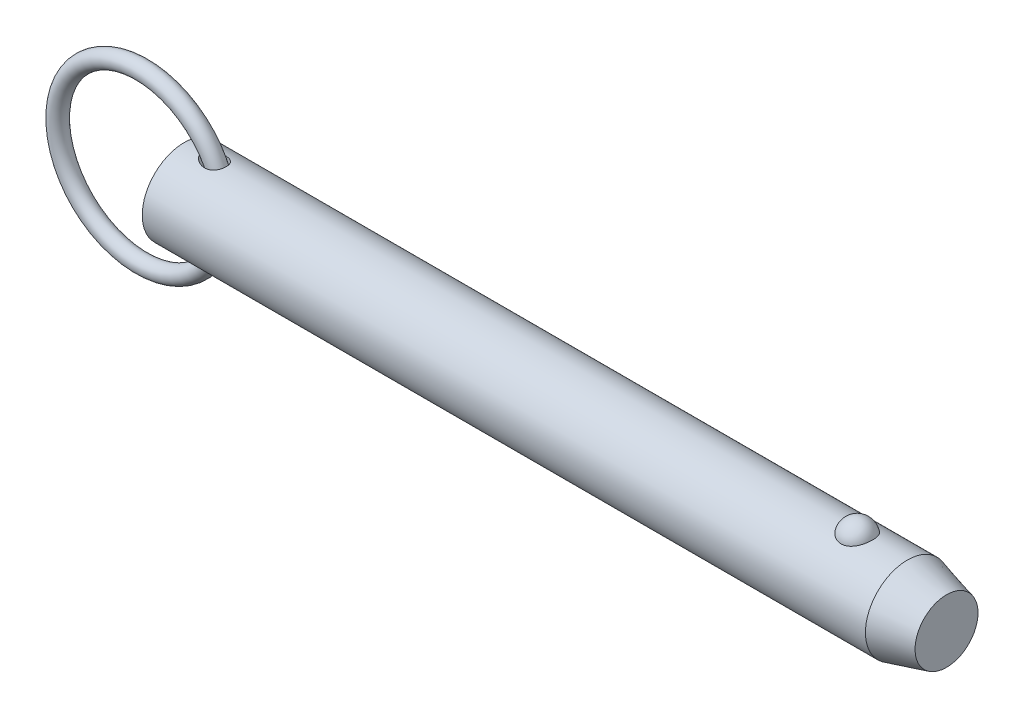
ISO-10303-21;
HEADER;
FILE_DESCRIPTION(('STEP AP214'),'2;1');
FILE_NAME('part.step','',(''),(''),'','','');
FILE_SCHEMA(('AUTOMOTIVE_DESIGN { 1 0 10303 214 1 1 1 1 }'));
ENDSEC;
DATA;
#1=APPLICATION_CONTEXT('core data for automotive mechanical design processes');
#2=APPLICATION_PROTOCOL_DEFINITION('international standard','automotive_design',2000,#1);
#3=PRODUCT_CONTEXT('',#1,'mechanical');
#4=PRODUCT('Part','Part','',(#3));
#5=PRODUCT_RELATED_PRODUCT_CATEGORY('part','',(#4));
#6=PRODUCT_DEFINITION_FORMATION('','',#4);
#7=PRODUCT_DEFINITION_CONTEXT('part definition',#1,'design');
#8=PRODUCT_DEFINITION('design','',#6,#7);
#9=PRODUCT_DEFINITION_SHAPE('','',#8);
#10=(LENGTH_UNIT() NAMED_UNIT(*) SI_UNIT(.MILLI.,.METRE.));
#11=(NAMED_UNIT(*) PLANE_ANGLE_UNIT() SI_UNIT($,.RADIAN.));
#12=(NAMED_UNIT(*) SI_UNIT($,.STERADIAN.) SOLID_ANGLE_UNIT());
#13=UNCERTAINTY_MEASURE_WITH_UNIT(LENGTH_MEASURE(1.E-05),#10,'distance_accuracy_value','');
#14=(GEOMETRIC_REPRESENTATION_CONTEXT(3) GLOBAL_UNCERTAINTY_ASSIGNED_CONTEXT((#13)) GLOBAL_UNIT_ASSIGNED_CONTEXT((#10,
#11,#12)) REPRESENTATION_CONTEXT('',''));
#15=CARTESIAN_POINT('',(0.,0.,0.));
#16=DIRECTION('',(0.,0.,1.));
#17=DIRECTION('',(1.,0.,0.));
#18=AXIS2_PLACEMENT_3D('',#15,#16,#17);
#19=CARTESIAN_POINT('',(-9.66825126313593,0.,0.));
#20=DIRECTION('',(0.,0.,1.));
#21=DIRECTION('',(1.,0.,0.));
#22=AXIS2_PLACEMENT_3D('',#19,#20,#21);
#23=TOROIDAL_SURFACE('',#22,19.05,1.905);
#24=CARTESIAN_POINT('',(11.2867487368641,0.,0.));
#25=VERTEX_POINT('',#24);
#26=VERTEX_LOOP('',#25);
#27=FACE_BOUND('',#26,.T.);
#28=ADVANCED_FACE('P0_F12',(#27),#23,.T.);
#29=CLOSED_SHELL('',(#28));
#30=MANIFOLD_SOLID_BREP('P0_B1',#29);
#31=CARTESIAN_POINT('',(0.,0.,0.));
#32=DIRECTION('',(1.,0.,0.));
#33=DIRECTION('',(0.,0.,-1.));
#34=AXIS2_PLACEMENT_3D('',#31,#32,#33);
#35=CYLINDRICAL_SURFACE('',#34,9.525);
#36=CARTESIAN_POINT('',(4.5669340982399,9.4314194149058,-1.33189820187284));
#37=CARTESIAN_POINT('',(4.70260475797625,9.41020313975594,-1.48215931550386));
#38=CARTESIAN_POINT('',(4.85555680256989,9.38755003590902,-1.61683982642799));
#39=CARTESIAN_POINT('',(5.10171959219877,9.35450554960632,-1.79512943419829));
#40=CARTESIAN_POINT('',(5.18674514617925,9.34362629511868,-1.85068909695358));
#41=CARTESIAN_POINT('',(5.3615438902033,9.32258514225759,-1.95392002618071));
#42=CARTESIAN_POINT('',(5.45131542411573,9.31242299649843,-2.00159402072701));
#43=CARTESIAN_POINT('',(5.70070211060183,9.28632120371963,-2.12033289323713));
#44=CARTESIAN_POINT('',(5.86420408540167,9.2714693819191,-2.18362944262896));
#45=CARTESIAN_POINT('',(6.19893345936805,9.24694163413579,-2.28525783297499));
#46=CARTESIAN_POINT('',(6.37015384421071,9.23726110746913,-2.32361187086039));
#47=CARTESIAN_POINT('',(6.73531776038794,9.22400982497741,-2.37575048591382));
#48=CARTESIAN_POINT('',(6.92975826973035,9.22118808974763,-2.38652934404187));
#49=CARTESIAN_POINT('',(7.21995443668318,9.22416297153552,-2.37494980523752));
#50=CARTESIAN_POINT('',(7.31643847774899,9.22635560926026,-2.366466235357));
#51=CARTESIAN_POINT('',(7.50796421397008,9.2331428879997,-2.33985028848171));
#52=CARTESIAN_POINT('',(7.6030065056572,9.23773650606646,-2.32172202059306));
#53=CARTESIAN_POINT('',(7.83273114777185,9.25183311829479,-2.26504721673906));
#54=CARTESIAN_POINT('',(7.96603028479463,9.26261470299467,-2.2209856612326));
#55=CARTESIAN_POINT('',(8.22310899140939,9.28816519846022,-2.11157306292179));
#56=CARTESIAN_POINT('',(8.34689477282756,9.30293147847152,-2.04623606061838));
#57=CARTESIAN_POINT('',(8.58136049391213,9.3349416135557,-1.89485344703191));
#58=CARTESIAN_POINT('',(8.69199721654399,9.35219324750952,-1.80874222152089));
#59=CARTESIAN_POINT('',(8.89592093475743,9.38707016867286,-1.6179918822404));
#60=CARTESIAN_POINT('',(8.98920771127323,9.40469546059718,-1.51335253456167));
#61=CARTESIAN_POINT('',(9.15057731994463,9.43713590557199,-1.29519427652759));
#62=CARTESIAN_POINT('',(9.21980158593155,9.45205440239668,-1.18253282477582));
#63=CARTESIAN_POINT('',(9.33826736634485,9.47856708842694,-0.946802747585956));
#64=CARTESIAN_POINT('',(9.38751161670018,9.49016173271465,-0.823735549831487));
#65=CARTESIAN_POINT('',(9.46423850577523,9.50859378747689,-0.572614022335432));
#66=CARTESIAN_POINT('',(9.49202393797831,9.5154972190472,-0.444656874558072));
#67=CARTESIAN_POINT('',(9.52636926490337,9.5240690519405,-0.18575268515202));
#68=CARTESIAN_POINT('',(9.53292923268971,9.52573747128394,-0.0548056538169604));
#69=CARTESIAN_POINT('',(9.52467276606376,9.52365852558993,0.206503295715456));
#70=CARTESIAN_POINT('',(9.50983454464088,9.51990564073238,0.33686448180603));
#71=CARTESIAN_POINT('',(9.45907362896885,9.50737852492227,0.593166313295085));
#72=CARTESIAN_POINT('',(9.42315106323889,9.49860432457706,0.719106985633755));
#73=CARTESIAN_POINT('',(9.33106648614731,9.4769892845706,0.962959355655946));
#74=CARTESIAN_POINT('',(9.27490839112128,9.46414923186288,1.08087260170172));
#75=CARTESIAN_POINT('',(9.14375803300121,9.43581000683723,1.30534632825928));
#76=CARTESIAN_POINT('',(9.06876720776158,9.42031103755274,1.41190767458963));
#77=CARTESIAN_POINT('',(8.90203187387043,9.38836719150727,1.61069439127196));
#78=CARTESIAN_POINT('',(8.81029913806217,9.37192298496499,1.70292975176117));
#79=CARTESIAN_POINT('',(8.61268775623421,9.33985045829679,1.87086859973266));
#80=CARTESIAN_POINT('',(8.50680947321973,9.3242221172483,1.94657251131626));
#81=CARTESIAN_POINT('',(8.28220546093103,9.29513431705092,2.08109032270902));
#82=CARTESIAN_POINT('',(8.16329919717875,9.28171415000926,2.13961034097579));
#83=CARTESIAN_POINT('',(7.91756052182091,9.25859072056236,2.23755716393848));
#84=CARTESIAN_POINT('',(7.79072606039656,9.24888842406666,2.27697900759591));
#85=CARTESIAN_POINT('',(7.52377913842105,9.23338749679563,2.33907806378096));
#86=CARTESIAN_POINT('',(7.38334767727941,9.22789571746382,2.36044900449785));
#87=CARTESIAN_POINT('',(7.10081394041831,9.22210229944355,2.3829751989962));
#88=CARTESIAN_POINT('',(6.95871103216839,9.22180269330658,2.38412253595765));
#89=CARTESIAN_POINT('',(6.65642691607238,9.22632724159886,2.36656230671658));
#90=CARTESIAN_POINT('',(6.49641694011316,9.23185415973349,2.3451317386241));
#91=CARTESIAN_POINT('',(6.18115433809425,9.24811737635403,2.28014143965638));
#92=CARTESIAN_POINT('',(6.02590710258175,9.25885936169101,2.23655754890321));
#93=CARTESIAN_POINT('',(5.69904720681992,9.28624254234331,2.12025087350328));
#94=CARTESIAN_POINT('',(5.52873601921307,9.30354853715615,2.04400672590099));
#95=CARTESIAN_POINT('',(5.20289495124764,9.34106989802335,1.86504730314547));
#96=CARTESIAN_POINT('',(5.04735968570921,9.36128419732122,1.76234172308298));
#97=CARTESIAN_POINT('',(4.7928712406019,9.39697639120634,1.55895334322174));
#98=CARTESIAN_POINT('',(4.68938704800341,9.41240250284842,1.46392900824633));
#99=CARTESIAN_POINT('',(4.4984714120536,9.44202586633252,1.25875918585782));
#100=CARTESIAN_POINT('',(4.41101129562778,9.45622528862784,1.1486413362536));
#101=CARTESIAN_POINT('',(4.27502257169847,9.47888210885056,0.940600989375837));
#102=CARTESIAN_POINT('',(4.22216329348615,9.48791121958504,0.84558680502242));
#103=CARTESIAN_POINT('',(4.1324147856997,9.50344321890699,0.648051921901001));
#104=CARTESIAN_POINT('',(4.0955118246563,9.50994827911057,0.545537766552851));
#105=CARTESIAN_POINT('',(4.04043124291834,9.51971586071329,0.334452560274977));
#106=CARTESIAN_POINT('',(4.02240728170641,9.52295176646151,0.22583927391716));
#107=CARTESIAN_POINT('',(4.00750873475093,9.52562364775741,0.00713006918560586));
#108=CARTESIAN_POINT('',(4.01062334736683,9.52506156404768,-0.102965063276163));
#109=CARTESIAN_POINT('',(4.03592967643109,9.52053221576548,-0.306944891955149));
#110=CARTESIAN_POINT('',(4.05571676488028,9.51699426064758,-0.401151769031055));
#111=CARTESIAN_POINT('',(4.10967975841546,9.5074546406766,-0.585176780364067));
#112=CARTESIAN_POINT('',(4.1438599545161,9.50145224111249,-0.674993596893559));
#113=CARTESIAN_POINT('',(4.23261356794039,9.48611703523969,-0.866116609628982));
#114=CARTESIAN_POINT('',(4.28990016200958,9.47635800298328,-0.966121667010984));
#115=CARTESIAN_POINT('',(4.41856577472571,9.45502867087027,-1.15640011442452));
#116=CARTESIAN_POINT('',(4.48996918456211,9.44345524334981,-1.24665623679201));
#117=CARTESIAN_POINT('',(4.5669340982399,9.4314194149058,-1.33189820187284));
#118=B_SPLINE_CURVE_WITH_KNOTS('',3,(#36,#37,#38,#39,#40,#41,#42,#43,#44,#45,#46,#47,#48,#49,
#50,#51,#52,#53,#54,#55,#56,#57,#58,#59,#60,#61,#62,#63,#64,#65,#66,#67,#68,#69,#70,#71,#72,#73,
#74,#75,#76,#77,#78,#79,#80,#81,#82,#83,#84,#85,#86,#87,#88,#89,#90,#91,#92,#93,#94,#95,#96,#97,
#98,#99,#100,#101,#102,#103,#104,#105,#106,#107,#108,#109,#110,#111,#112,#113,#114,#115,#116,
#117),.UNSPECIFIED.,.T.,.F.,(4,2,2,2,2,2,2,2,2,2,2,2,2,2,2,2,2,2,2,2,2,2,2,2,2,2,2,2,2,2,2,2,2,
2,2,2,2,2,2,2,4),(0.,0.609951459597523,0.916123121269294,1.22218863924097,1.74791337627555,
2.27316961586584,2.85362722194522,3.14383229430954,3.43391382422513,3.85437497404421,
4.27455920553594,4.69608835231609,5.11762282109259,5.5149005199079,5.91212379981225,
6.30363414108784,6.69514313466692,7.08705103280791,7.47895654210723,7.87078624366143,
8.26258603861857,8.65411137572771,9.04562666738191,9.44349251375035,9.84146165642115,
10.2662286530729,10.6911619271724,11.1739180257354,11.6572017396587,12.2170157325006,
12.776624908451,13.1992556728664,13.6211226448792,13.9471990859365,14.2729943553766,
14.6014211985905,14.9296802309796,15.2173810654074,15.505167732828,15.8505863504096,
16.1966070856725),.UNSPECIFIED.);
#119=CARTESIAN_POINT('',(4.5669340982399,9.4314194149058,-1.33189820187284));
#120=VERTEX_POINT('',#119);
#121=EDGE_CURVE('P1_E40',#120,#120,#118,.T.);
#122=ORIENTED_EDGE('',*,*,#121,.T.);
#123=EDGE_LOOP('',(#122));
#124=FACE_BOUND('',#123,.T.);
#125=CARTESIAN_POINT('',(164.143054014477,0.,0.));
#126=DIRECTION('',(1.,0.,0.));
#127=DIRECTION('',(0.,0.,-1.));
#128=AXIS2_PLACEMENT_3D('',#125,#126,#127);
#129=CIRCLE('',#128,9.525);
#130=CARTESIAN_POINT('',(164.143054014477,0.,-9.525));
#131=VERTEX_POINT('',#130);
#132=EDGE_CURVE('P1_E25',#131,#131,#129,.T.);
#133=ORIENTED_EDGE('',*,*,#132,.F.);
#134=EDGE_LOOP('',(#133));
#135=FACE_BOUND('',#134,.T.);
#136=CARTESIAN_POINT('',(0.,0.,0.));
#137=DIRECTION('',(1.,0.,0.));
#138=DIRECTION('',(0.,0.,-1.));
#139=AXIS2_PLACEMENT_3D('',#136,#137,#138);
#140=CIRCLE('',#139,9.525);
#141=CARTESIAN_POINT('',(0.,0.,-9.525));
#142=VERTEX_POINT('',#141);
#143=EDGE_CURVE('P1_E9',#142,#142,#140,.T.);
#144=ORIENTED_EDGE('',*,*,#143,.T.);
#145=EDGE_LOOP('',(#144));
#146=FACE_BOUND('',#145,.T.);
#147=CARTESIAN_POINT('',(152.745757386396,8.80405803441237,3.63513233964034));
#148=CARTESIAN_POINT('',(152.651676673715,8.80405953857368,3.63513053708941));
#149=CARTESIAN_POINT('',(152.557561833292,8.80561325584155,3.63137461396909));
#150=CARTESIAN_POINT('',(152.370012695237,8.81177748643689,3.61638665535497));
#151=CARTESIAN_POINT('',(152.276578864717,8.81638992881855,3.60514990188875));
#152=CARTESIAN_POINT('',(151.997945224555,8.83467114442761,3.56024627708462));
#153=CARTESIAN_POINT('',(151.814691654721,8.85278327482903,3.5153862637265));
#154=CARTESIAN_POINT('',(151.459509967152,8.89871214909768,3.39742145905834));
#155=CARTESIAN_POINT('',(151.287553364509,8.92650327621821,3.32439116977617));
#156=CARTESIAN_POINT('',(150.958707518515,8.9887481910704,3.15220244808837));
#157=CARTESIAN_POINT('',(150.801811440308,9.02319893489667,3.05305594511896));
#158=CARTESIAN_POINT('',(150.502214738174,9.09629186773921,2.82797815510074));
#159=CARTESIAN_POINT('',(150.360060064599,9.13502685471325,2.70135138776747));
#160=CARTESIAN_POINT('',(150.098299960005,9.21186572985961,2.42641932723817));
#161=CARTESIAN_POINT('',(149.978701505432,9.24996941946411,2.2781073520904));
#162=CARTESIAN_POINT('',(149.759645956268,9.32341082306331,1.95652290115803));
#163=CARTESIAN_POINT('',(149.661317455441,9.35855090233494,1.78243511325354));
#164=CARTESIAN_POINT('',(149.493819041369,9.42045142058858,1.41937246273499));
#165=CARTESIAN_POINT('',(149.424651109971,9.44721128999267,1.23039658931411));
#166=CARTESIAN_POINT('',(149.316199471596,9.48990641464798,0.840370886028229));
#167=CARTESIAN_POINT('',(149.277288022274,9.50570658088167,0.639202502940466));
#168=CARTESIAN_POINT('',(149.231555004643,9.52433146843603,0.232664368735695));
#169=CARTESIAN_POINT('',(149.224732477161,9.52715657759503,0.027294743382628));
#170=CARTESIAN_POINT('',(149.243255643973,9.51956918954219,-0.380478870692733));
#171=CARTESIAN_POINT('',(149.268405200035,9.50923740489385,-0.582893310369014));
#172=CARTESIAN_POINT('',(149.35002537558,9.47651897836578,-0.98029399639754));
#173=CARTESIAN_POINT('',(149.406496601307,9.45413210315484,-1.17528009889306));
#174=CARTESIAN_POINT('',(149.549719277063,9.39954044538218,-1.55263697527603));
#175=CARTESIAN_POINT('',(149.636512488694,9.36732213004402,-1.73498993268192));
#176=CARTESIAN_POINT('',(149.838610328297,9.29640700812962,-2.08177763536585));
#177=CARTESIAN_POINT('',(149.953917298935,9.25770966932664,-2.24621090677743));
#178=CARTESIAN_POINT('',(150.211264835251,9.17775604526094,-2.5533833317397));
#179=CARTESIAN_POINT('',(150.353434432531,9.136488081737,-2.696011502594));
#180=CARTESIAN_POINT('',(150.66089985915,9.05620497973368,-2.95451229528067));
#181=CARTESIAN_POINT('',(150.826193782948,9.01718965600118,-3.07038711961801));
#182=CARTESIAN_POINT('',(151.172052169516,8.94680019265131,-3.26976836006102));
#183=CARTESIAN_POINT('',(151.352227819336,8.91528408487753,-3.353897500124));
#184=CARTESIAN_POINT('',(151.725651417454,8.86272514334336,-3.49043503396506));
#185=CARTESIAN_POINT('',(151.918894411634,8.84167836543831,-3.54285537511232));
#186=CARTESIAN_POINT('',(152.302503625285,8.81348056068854,-3.61241306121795));
#187=CARTESIAN_POINT('',(152.492525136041,8.80568348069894,-3.6311933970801));
#188=CARTESIAN_POINT('',(152.873190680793,8.80289410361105,-3.63795342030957));
#189=CARTESIAN_POINT('',(153.063834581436,8.80789922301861,-3.62593932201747));
#190=CARTESIAN_POINT('',(153.434007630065,8.82974915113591,-3.57238430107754));
#191=CARTESIAN_POINT('',(153.613697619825,8.84621463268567,-3.53178890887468));
#192=CARTESIAN_POINT('',(153.963422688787,8.88875330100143,-3.42331083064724));
#193=CARTESIAN_POINT('',(154.133456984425,8.91482726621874,-3.35542593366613));
#194=CARTESIAN_POINT('',(154.463237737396,8.97448239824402,-3.19248225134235));
#195=CARTESIAN_POINT('',(154.622680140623,9.00821446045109,-3.0968647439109));
#196=CARTESIAN_POINT('',(154.923513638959,9.07935398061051,-2.88162736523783));
#197=CARTESIAN_POINT('',(155.064900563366,9.11676228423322,-2.76200196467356));
#198=CARTESIAN_POINT('',(155.33331931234,9.19347419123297,-2.49516285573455));
#199=CARTESIAN_POINT('',(155.459275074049,9.23277872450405,-2.34686614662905));
#200=CARTESIAN_POINT('',(155.685522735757,9.30737610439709,-2.03093683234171));
#201=CARTESIAN_POINT('',(155.78581004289,9.34266823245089,-1.86330077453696));
#202=CARTESIAN_POINT('',(155.961514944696,9.40674710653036,-1.50744893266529));
#203=CARTESIAN_POINT('',(156.036041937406,9.43529176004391,-1.31874876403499));
#204=CARTESIAN_POINT('',(156.15416505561,9.48144132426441,-0.930631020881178));
#205=CARTESIAN_POINT('',(156.197760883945,9.49904612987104,-0.731213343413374));
#206=CARTESIAN_POINT('',(156.253158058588,9.5215314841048,-0.327147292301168));
#207=CARTESIAN_POINT('',(156.264935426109,9.52640243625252,-0.122495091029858));
#208=CARTESIAN_POINT('',(156.256382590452,9.5228957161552,0.286018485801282));
#209=CARTESIAN_POINT('',(156.23605305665,9.5145183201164,0.489879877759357));
#210=CARTESIAN_POINT('',(156.163884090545,9.48544083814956,0.889994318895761));
#211=CARTESIAN_POINT('',(156.112199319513,9.46480124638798,1.08627971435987));
#212=CARTESIAN_POINT('',(155.978491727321,9.4133389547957,1.46682086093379));
#213=CARTESIAN_POINT('',(155.896466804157,9.38251554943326,1.65107577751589));
#214=CARTESIAN_POINT('',(155.70319292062,9.31365636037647,2.00346348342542));
#215=CARTESIAN_POINT('',(155.591783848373,9.27558138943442,2.17150083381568));
#216=CARTESIAN_POINT('',(155.342294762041,9.19638714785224,2.48563115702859));
#217=CARTESIAN_POINT('',(155.204216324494,9.15526805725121,2.63172542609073));
#218=CARTESIAN_POINT('',(154.904843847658,9.07465393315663,2.89750997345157));
#219=CARTESIAN_POINT('',(154.743610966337,9.03515496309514,3.01726776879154));
#220=CARTESIAN_POINT('',(154.401613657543,8.96227564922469,3.22732920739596));
#221=CARTESIAN_POINT('',(154.220841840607,8.92889763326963,3.31762165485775));
#222=CARTESIAN_POINT('',(153.851445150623,8.8734538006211,3.46314419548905));
#223=CARTESIAN_POINT('',(153.66332371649,8.85102983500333,3.51950082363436));
#224=CARTESIAN_POINT('',(153.37578699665,8.8266696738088,3.57993683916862));
#225=CARTESIAN_POINT('',(153.279133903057,8.82009725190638,3.5960621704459));
#226=CARTESIAN_POINT('',(153.084677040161,8.81020897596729,3.62022512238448));
#227=CARTESIAN_POINT('',(152.98687410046,8.80689090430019,3.62826825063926));
#228=CARTESIAN_POINT('',(152.841224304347,8.80445615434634,3.63416760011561));
#229=CARTESIAN_POINT('',(152.793495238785,8.80405727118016,3.63513325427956));
#230=CARTESIAN_POINT('',(152.745757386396,8.80405803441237,3.63513233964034));
#231=B_SPLINE_CURVE_WITH_KNOTS('',3,(#147,#148,#149,#150,#151,#152,#153,#154,#155,#156,#157,
#158,#159,#160,#161,#162,#163,#164,#165,#166,#167,#168,#169,#170,#171,#172,#173,#174,#175,#176,
#177,#178,#179,#180,#181,#182,#183,#184,#185,#186,#187,#188,#189,#190,#191,#192,#193,#194,#195,
#196,#197,#198,#199,#200,#201,#202,#203,#204,#205,#206,#207,#208,#209,#210,#211,#212,#213,#214,
#215,#216,#217,#218,#219,#220,#221,#222,#223,#224,#225,#226,#227,#228,#229,#230),.UNSPECIFIED.,
.T.,.F.,(4,2,2,2,2,2,2,2,2,2,2,2,2,2,2,2,2,2,2,2,2,2,2,2,2,2,2,2,2,2,2,2,2,2,2,2,2,2,2,2,2,4),
(0.,0.282202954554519,0.564584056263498,1.13017050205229,1.69427128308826,2.25811483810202,
2.83836627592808,3.41879688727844,4.02497117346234,4.63118665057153,5.24474754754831,
5.85829010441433,6.46808687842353,7.07789545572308,7.6885472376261,8.299249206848,
8.91296283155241,9.52662591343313,10.1275338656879,10.7282152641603,11.2986646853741,
11.8689989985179,12.4213015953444,12.973648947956,13.5380053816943,14.1024919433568,
14.695298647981,15.2882113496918,15.8999469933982,16.5116885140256,17.1238909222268,
17.7360805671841,18.3452748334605,18.9545113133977,19.567138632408,20.179729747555,
20.7907316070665,21.4019653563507,21.9915938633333,22.2859053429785,22.5800161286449,
22.7232098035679),.UNSPECIFIED.);
#232=CARTESIAN_POINT('',(152.745757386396,8.80405803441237,3.63513233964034));
#233=VERTEX_POINT('',#232);
#234=EDGE_CURVE('P1_E34',#233,#233,#231,.T.);
#235=ORIENTED_EDGE('',*,*,#234,.T.);
#236=EDGE_LOOP('',(#235));
#237=FACE_BOUND('',#236,.T.);
#238=CARTESIAN_POINT('',(4.5669340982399,-9.4314194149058,-1.33189820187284));
#239=CARTESIAN_POINT('',(4.48932984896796,-9.4435553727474,-1.24594548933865));
#240=CARTESIAN_POINT('',(4.41737309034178,-9.45522193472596,-1.1548795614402));
#241=CARTESIAN_POINT('',(4.28781047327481,-9.47670896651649,-0.962782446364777));
#242=CARTESIAN_POINT('',(4.23019403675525,-9.48653079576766,-0.861758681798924));
#243=CARTESIAN_POINT('',(4.132545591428,-9.5034118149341,-0.649723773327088));
#244=CARTESIAN_POINT('',(4.09271158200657,-9.51043980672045,-0.538615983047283));
#245=CARTESIAN_POINT('',(4.04973167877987,-9.51806966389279,-0.367764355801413));
#246=CARTESIAN_POINT('',(4.03820037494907,-9.52012756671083,-0.310118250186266));
#247=CARTESIAN_POINT('',(4.02100287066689,-9.52320274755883,-0.193935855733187));
#248=CARTESIAN_POINT('',(4.0153356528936,-9.52422020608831,-0.135399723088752));
#249=CARTESIAN_POINT('',(4.0081707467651,-9.52550497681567,0.0247266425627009));
#250=CARTESIAN_POINT('',(4.0127049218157,-9.52468821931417,0.126661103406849));
#251=CARTESIAN_POINT('',(4.03954973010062,-9.51988506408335,0.328012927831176));
#252=CARTESIAN_POINT('',(4.06186450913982,-9.51589792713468,0.427429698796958));
#253=CARTESIAN_POINT('',(4.12088980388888,-9.50548528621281,0.616362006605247));
#254=CARTESIAN_POINT('',(4.15684838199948,-9.49918763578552,0.706123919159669));
#255=CARTESIAN_POINT('',(4.24094647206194,-9.48470618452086,0.87952277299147));
#256=CARTESIAN_POINT('',(4.28909090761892,-9.47652162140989,0.963157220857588));
#257=CARTESIAN_POINT('',(4.42295891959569,-9.45426317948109,1.16513741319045));
#258=CARTESIAN_POINT('',(4.51523752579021,-9.43933320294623,1.27905352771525));
#259=CARTESIAN_POINT('',(4.71682295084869,-9.40825940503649,1.49055892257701));
#260=CARTESIAN_POINT('',(4.82617286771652,-9.39211256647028,1.58810554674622));
#261=CARTESIAN_POINT('',(5.09064226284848,-9.35555264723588,1.79246125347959));
#262=CARTESIAN_POINT('',(5.2499041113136,-9.33524115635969,1.89393122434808));
#263=CARTESIAN_POINT('',(5.58309255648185,-9.29785396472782,2.06968659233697));
#264=CARTESIAN_POINT('',(5.75702897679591,-9.28078045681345,2.14395359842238));
#265=CARTESIAN_POINT('',(6.11646882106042,-9.25213303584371,2.26440412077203));
#266=CARTESIAN_POINT('',(6.30205582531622,-9.2406056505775,2.31035092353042));
#267=CARTESIAN_POINT('',(6.67856093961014,-9.22541807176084,2.37029728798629));
#268=CARTESIAN_POINT('',(6.86947045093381,-9.22174585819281,2.38434566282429));
#269=CARTESIAN_POINT('',(7.21217144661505,-9.22344239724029,2.37775005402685));
#270=CARTESIAN_POINT('',(7.36409439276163,-9.22713860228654,2.36352577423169));
#271=CARTESIAN_POINT('',(7.66346227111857,-9.24048072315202,2.31082299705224));
#272=CARTESIAN_POINT('',(7.81090958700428,-9.25012341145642,2.27235765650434));
#273=CARTESIAN_POINT('',(8.09730316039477,-9.2746609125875,2.17003648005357));
#274=CARTESIAN_POINT('',(8.23619652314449,-9.28958517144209,2.10603803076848));
#275=CARTESIAN_POINT('',(8.49918675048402,-9.32290326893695,1.95324442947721));
#276=CARTESIAN_POINT('',(8.62328895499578,-9.34129584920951,1.86445826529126));
#277=CARTESIAN_POINT('',(8.84006515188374,-9.37706953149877,1.67466761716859));
#278=CARTESIAN_POINT('',(8.93465172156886,-9.39436331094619,1.57582357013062));
#279=CARTESIAN_POINT('',(9.10490234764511,-9.42761680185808,1.36280955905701));
#280=CARTESIAN_POINT('',(9.18057146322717,-9.44357686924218,1.24864370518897));
#281=CARTESIAN_POINT('',(9.30789178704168,-9.47159985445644,1.01379272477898));
#282=CARTESIAN_POINT('',(9.36045544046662,-9.48380365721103,0.893617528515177));
#283=CARTESIAN_POINT('',(9.44498362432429,-9.50388751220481,0.64589020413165));
#284=CARTESIAN_POINT('',(9.47694947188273,-9.51176784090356,0.518338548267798));
#285=CARTESIAN_POINT('',(9.51944262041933,-9.52232073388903,0.260103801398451));
#286=CARTESIAN_POINT('',(9.53006646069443,-9.52501674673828,0.129437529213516));
#287=CARTESIAN_POINT('',(9.52993291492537,-9.52498309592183,-0.131885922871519));
#288=CARTESIAN_POINT('',(9.51917525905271,-9.52225336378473,-0.262543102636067));
#289=CARTESIAN_POINT('',(9.47648788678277,-9.51165418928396,-0.520312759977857));
#290=CARTESIAN_POINT('',(9.44453086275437,-9.50377811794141,-0.647420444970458));
#291=CARTESIAN_POINT('',(9.36015568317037,-9.48373425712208,-0.894290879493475));
#292=CARTESIAN_POINT('',(9.30773827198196,-9.47156662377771,-1.01405389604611));
#293=CARTESIAN_POINT('',(9.18380895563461,-9.44428888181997,-1.24269386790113));
#294=CARTESIAN_POINT('',(9.11232064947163,-9.42918241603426,-1.35158405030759));
#295=CARTESIAN_POINT('',(8.9521268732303,-9.39767706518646,-1.55562459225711));
#296=CARTESIAN_POINT('',(8.86342281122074,-9.3812782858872,-1.65077607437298));
#297=CARTESIAN_POINT('',(8.67104443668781,-9.34891827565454,-1.8251751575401));
#298=CARTESIAN_POINT('',(8.56732858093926,-9.33295841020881,-1.90437711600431));
#299=CARTESIAN_POINT('',(8.3481843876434,-9.30317889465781,-2.0449122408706));
#300=CARTESIAN_POINT('',(8.23275529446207,-9.28935938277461,-2.10624425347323));
#301=CARTESIAN_POINT('',(7.9896124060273,-9.26475003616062,-2.2120340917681));
#302=CARTESIAN_POINT('',(7.86162088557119,-9.25407358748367,-2.25587700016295));
#303=CARTESIAN_POINT('',(7.60027499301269,-9.23720810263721,-2.32397032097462));
#304=CARTESIAN_POINT('',(7.46691858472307,-9.23102078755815,-2.34821321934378));
#305=CARTESIAN_POINT('',(7.18516230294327,-9.22302718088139,-2.37943079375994));
#306=CARTESIAN_POINT('',(7.03654454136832,-9.22169704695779,-2.38452997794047));
#307=CARTESIAN_POINT('',(6.74015049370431,-9.22442327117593,-2.37395141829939));
#308=CARTESIAN_POINT('',(6.5923745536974,-9.22848170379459,-2.35826567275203));
#309=CARTESIAN_POINT('',(6.27762777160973,-9.2422287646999,-2.30385559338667));
#310=CARTESIAN_POINT('',(6.11124715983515,-9.25269504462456,-2.26192683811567));
#311=CARTESIAN_POINT('',(5.78635920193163,-9.27830776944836,-2.15445569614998));
#312=CARTESIAN_POINT('',(5.62786567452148,-9.29346211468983,-2.08887341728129));
#313=CARTESIAN_POINT('',(5.39013065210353,-9.31931237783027,-1.96924953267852));
#314=CARTESIAN_POINT('',(5.30683088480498,-9.32901725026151,-1.92292485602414));
#315=CARTESIAN_POINT('',(5.14455801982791,-9.34899035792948,-1.82334419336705));
#316=CARTESIAN_POINT('',(5.06558607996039,-9.35925874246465,-1.77008636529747));
#317=CARTESIAN_POINT('',(4.83670950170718,-9.39034445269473,-1.60010986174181));
#318=CARTESIAN_POINT('',(4.69422471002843,-9.41151337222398,-1.47288240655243));
#319=CARTESIAN_POINT('',(4.5669340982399,-9.4314194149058,-1.33189820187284));
#320=B_SPLINE_CURVE_WITH_KNOTS('',3,(#238,#239,#240,#241,#242,#243,#244,#245,#246,#247,#248,
#249,#250,#251,#252,#253,#254,#255,#256,#257,#258,#259,#260,#261,#262,#263,#264,#265,#266,#267,
#268,#269,#270,#271,#272,#273,#274,#275,#276,#277,#278,#279,#280,#281,#282,#283,#284,#285,#286,
#287,#288,#289,#290,#291,#292,#293,#294,#295,#296,#297,#298,#299,#300,#301,#302,#303,#304,#305,
#306,#307,#308,#309,#310,#311,#312,#313,#314,#315,#316,#317,#318,#319),.UNSPECIFIED.,.T.,.F.,(4,
2,2,2,2,2,2,2,2,2,2,2,2,2,2,2,2,2,2,2,2,2,2,2,2,2,2,2,2,2,2,2,2,2,2,2,2,2,2,2,4),(0.,
0.348900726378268,0.697543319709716,1.0499765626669,1.22617690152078,1.40234666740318,
1.70666745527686,2.01105922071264,2.30066493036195,2.59038784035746,3.03001384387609,
3.47076822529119,4.03766594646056,4.60494622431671,5.17690598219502,5.74798989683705,
6.20400848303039,6.65977977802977,7.11813321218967,7.57632066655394,7.98791759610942,
8.39940433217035,8.79273459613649,9.18603970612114,9.57756168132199,9.96908859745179,
10.3611208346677,10.7531388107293,11.1446739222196,11.536177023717,11.9287850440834,
12.3214184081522,12.7268448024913,13.1324265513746,13.5768390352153,14.0214226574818,
14.5351685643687,15.0497849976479,15.3368801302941,15.6240516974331,16.1963372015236),.UNSPECIFIED.);
#321=CARTESIAN_POINT('',(4.5669340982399,-9.4314194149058,-1.33189820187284));
#322=VERTEX_POINT('',#321);
#323=EDGE_CURVE('P1_E17',#322,#322,#320,.T.);
#324=ORIENTED_EDGE('',*,*,#323,.T.);
#325=EDGE_LOOP('',(#324));
#326=FACE_BOUND('',#325,.T.);
#327=ADVANCED_FACE('P1_F13',(#124,#135,#146,#237,#326),#35,.T.);
#328=CARTESIAN_POINT('',(0.,0.,0.));
#329=DIRECTION('',(-1.,0.,0.));
#330=DIRECTION('',(0.,0.,1.));
#331=AXIS2_PLACEMENT_3D('',#328,#329,#330);
#332=PLANE('',#331);
#333=ORIENTED_EDGE('',*,*,#143,.F.);
#334=EDGE_LOOP('',(#333));
#335=FACE_BOUND('',#334,.T.);
#336=ADVANCED_FACE('P1_F15',(#335),#332,.T.);
#337=CARTESIAN_POINT('',(173.03,0.,0.));
#338=DIRECTION('',(-1.,0.,0.));
#339=DIRECTION('',(0.,0.,1.));
#340=AXIS2_PLACEMENT_3D('',#337,#338,#339);
#341=CONICAL_SURFACE('',#340,7.14375000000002,0.26179938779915);
#342=ORIENTED_EDGE('',*,*,#132,.T.);
#343=EDGE_LOOP('',(#342));
#344=FACE_BOUND('',#343,.T.);
#345=CARTESIAN_POINT('',(173.03,0.,0.));
#346=DIRECTION('',(1.,0.,0.));
#347=DIRECTION('',(0.,0.,-1.));
#348=AXIS2_PLACEMENT_3D('',#345,#346,#347);
#349=CIRCLE('',#348,7.14375000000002);
#350=CARTESIAN_POINT('',(173.03,0.,-7.14375000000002));
#351=VERTEX_POINT('',#350);
#352=EDGE_CURVE('P1_E30',#351,#351,#349,.T.);
#353=ORIENTED_EDGE('',*,*,#352,.F.);
#354=EDGE_LOOP('',(#353));
#355=FACE_BOUND('',#354,.T.);
#356=ADVANCED_FACE('P1_F55',(#344,#355),#341,.T.);
#357=CARTESIAN_POINT('',(173.03,7.14375000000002,0.));
#358=DIRECTION('',(1.,0.,0.));
#359=DIRECTION('',(0.,0.,-1.));
#360=AXIS2_PLACEMENT_3D('',#357,#358,#359);
#361=PLANE('',#360);
#362=ORIENTED_EDGE('',*,*,#352,.T.);
#363=EDGE_LOOP('',(#362));
#364=FACE_BOUND('',#363,.T.);
#365=ADVANCED_FACE('P1_F51',(#364),#361,.T.);
#366=CARTESIAN_POINT('',(152.745757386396,8.5725,0.));
#367=DIRECTION('',(-1.,0.,0.));
#368=DIRECTION('',(0.,1.,0.));
#369=AXIS2_PLACEMENT_3D('',#366,#367,#368);
#370=SPHERICAL_SURFACE('',#369,3.64249999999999);
#371=ORIENTED_EDGE('',*,*,#234,.F.);
#372=EDGE_LOOP('',(#371));
#373=FACE_BOUND('',#372,.T.);
#374=ADVANCED_FACE('P1_F46',(#373),#370,.T.);
#375=CARTESIAN_POINT('',(-9.66825126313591,0.,0.));
#376=DIRECTION('',(0.,0.,1.));
#377=DIRECTION('',(1.,0.,0.));
#378=AXIS2_PLACEMENT_3D('',#375,#376,#377);
#379=TOROIDAL_SURFACE('',#378,19.05,2.38125);
#380=ORIENTED_EDGE('',*,*,#323,.F.);
#381=EDGE_LOOP('',(#380));
#382=FACE_BOUND('',#381,.T.);
#383=ORIENTED_EDGE('',*,*,#121,.F.);
#384=EDGE_LOOP('',(#383));
#385=FACE_BOUND('',#384,.T.);
#386=ADVANCED_FACE('P1_F50',(#382,#385),#379,.F.);
#387=CLOSED_SHELL('',(#327,#336,#356,#365,#374,#386));
#388=MANIFOLD_SOLID_BREP('P1_B1',#387);
#389=ADVANCED_BREP_SHAPE_REPRESENTATION('',(#18,#30,#388),#14);
#390=SHAPE_DEFINITION_REPRESENTATION(#9,#389);
ENDSEC;
END-ISO-10303-21;
